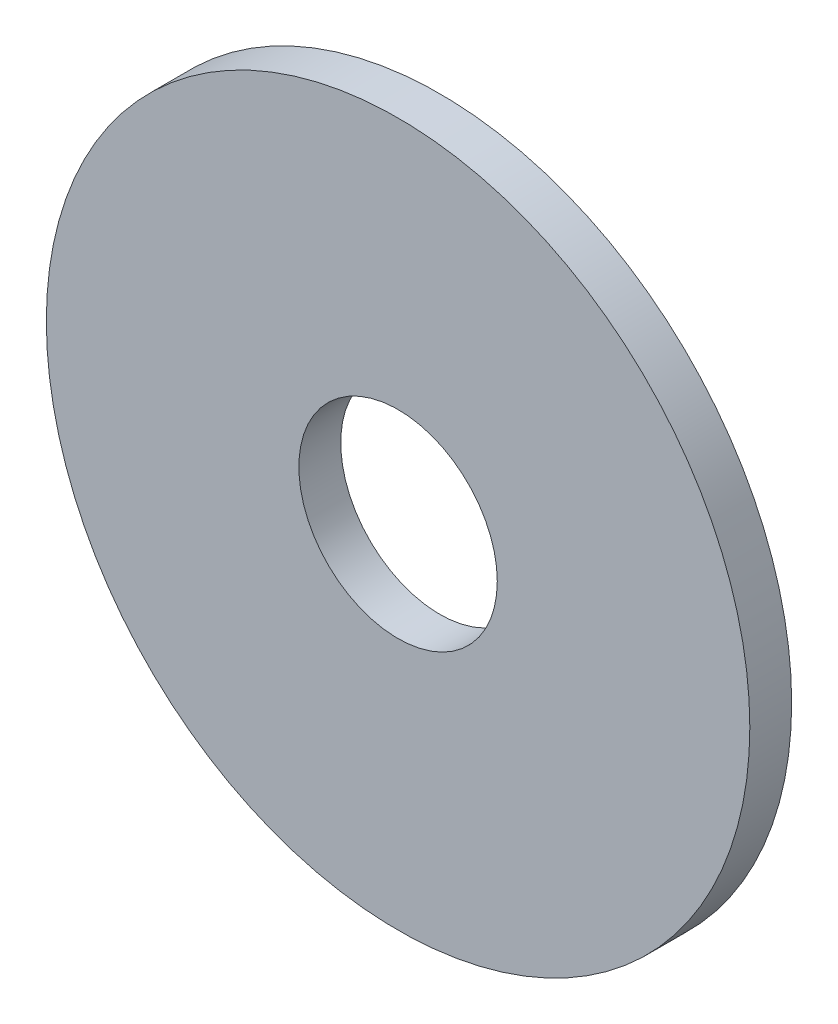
ISO-10303-21;
HEADER;
FILE_DESCRIPTION(('STEP AP214'),'2;1');
FILE_NAME('part.step','',(''),(''),'','','');
FILE_SCHEMA(('AUTOMOTIVE_DESIGN { 1 0 10303 214 1 1 1 1 }'));
ENDSEC;
DATA;
#1=APPLICATION_CONTEXT('core data for automotive mechanical design processes');
#2=APPLICATION_PROTOCOL_DEFINITION('international standard','automotive_design',2000,#1);
#3=PRODUCT_CONTEXT('',#1,'mechanical');
#4=PRODUCT('Part','Part','',(#3));
#5=PRODUCT_RELATED_PRODUCT_CATEGORY('part','',(#4));
#6=PRODUCT_DEFINITION_FORMATION('','',#4);
#7=PRODUCT_DEFINITION_CONTEXT('part definition',#1,'design');
#8=PRODUCT_DEFINITION('design','',#6,#7);
#9=PRODUCT_DEFINITION_SHAPE('','',#8);
#10=(LENGTH_UNIT() NAMED_UNIT(*) SI_UNIT(.MILLI.,.METRE.));
#11=(NAMED_UNIT(*) PLANE_ANGLE_UNIT() SI_UNIT($,.RADIAN.));
#12=(NAMED_UNIT(*) SI_UNIT($,.STERADIAN.) SOLID_ANGLE_UNIT());
#13=UNCERTAINTY_MEASURE_WITH_UNIT(LENGTH_MEASURE(1.E-05),#10,'distance_accuracy_value','');
#14=(GEOMETRIC_REPRESENTATION_CONTEXT(3) GLOBAL_UNCERTAINTY_ASSIGNED_CONTEXT((#13)) GLOBAL_UNIT_ASSIGNED_CONTEXT((#10,
#11,#12)) REPRESENTATION_CONTEXT('',''));
#15=CARTESIAN_POINT('',(0.,0.,0.));
#16=DIRECTION('',(0.,0.,1.));
#17=DIRECTION('',(1.,0.,0.));
#18=AXIS2_PLACEMENT_3D('',#15,#16,#17);
#19=CARTESIAN_POINT('',(0.,0.,0.));
#20=DIRECTION('',(0.,0.,-1.));
#21=DIRECTION('',(-1.,0.,0.));
#22=AXIS2_PLACEMENT_3D('',#19,#20,#21);
#23=PLANE('',#22);
#24=CARTESIAN_POINT('',(0.,0.,0.));
#25=DIRECTION('',(0.,0.,1.));
#26=DIRECTION('',(1.,0.,0.));
#27=AXIS2_PLACEMENT_3D('',#24,#25,#26);
#28=CIRCLE('',#27,2.75);
#29=CARTESIAN_POINT('',(2.75,0.,0.));
#30=VERTEX_POINT('',#29);
#31=EDGE_CURVE('E26',#30,#30,#28,.T.);
#32=ORIENTED_EDGE('',*,*,#31,.T.);
#33=EDGE_LOOP('',(#32));
#34=FACE_BOUND('',#33,.T.);
#35=CARTESIAN_POINT('',(0.,0.,0.));
#36=DIRECTION('',(0.,0.,1.));
#37=DIRECTION('',(1.,0.,0.));
#38=AXIS2_PLACEMENT_3D('',#35,#36,#37);
#39=CIRCLE('',#38,9.75);
#40=CARTESIAN_POINT('',(9.75,0.,0.));
#41=VERTEX_POINT('',#40);
#42=EDGE_CURVE('E17',#41,#41,#39,.T.);
#43=ORIENTED_EDGE('',*,*,#42,.F.);
#44=EDGE_LOOP('',(#43));
#45=FACE_BOUND('',#44,.T.);
#46=ADVANCED_FACE('F14',(#34,#45),#23,.T.);
#47=CARTESIAN_POINT('',(0.,0.,0.));
#48=DIRECTION('',(0.,0.,1.));
#49=DIRECTION('',(1.,0.,0.));
#50=AXIS2_PLACEMENT_3D('',#47,#48,#49);
#51=CYLINDRICAL_SURFACE('',#50,9.75);
#52=ORIENTED_EDGE('',*,*,#42,.T.);
#53=EDGE_LOOP('',(#52));
#54=FACE_BOUND('',#53,.T.);
#55=CARTESIAN_POINT('',(0.,0.,1.16));
#56=DIRECTION('',(0.,0.,1.));
#57=DIRECTION('',(1.,0.,0.));
#58=AXIS2_PLACEMENT_3D('',#55,#56,#57);
#59=CIRCLE('',#58,9.75);
#60=CARTESIAN_POINT('',(9.75,0.,1.16));
#61=VERTEX_POINT('',#60);
#62=EDGE_CURVE('E21',#61,#61,#59,.F.);
#63=ORIENTED_EDGE('',*,*,#62,.T.);
#64=EDGE_LOOP('',(#63));
#65=FACE_BOUND('',#64,.T.);
#66=ADVANCED_FACE('F34',(#54,#65),#51,.T.);
#67=CARTESIAN_POINT('',(0.,0.,0.));
#68=DIRECTION('',(0.,0.,1.));
#69=DIRECTION('',(1.,0.,0.));
#70=AXIS2_PLACEMENT_3D('',#67,#68,#69);
#71=CYLINDRICAL_SURFACE('',#70,2.75);
#72=ORIENTED_EDGE('',*,*,#31,.F.);
#73=EDGE_LOOP('',(#72));
#74=FACE_BOUND('',#73,.T.);
#75=CARTESIAN_POINT('',(0.,0.,1.16));
#76=DIRECTION('',(0.,0.,1.));
#77=DIRECTION('',(1.,0.,0.));
#78=AXIS2_PLACEMENT_3D('',#75,#76,#77);
#79=CIRCLE('',#78,2.75);
#80=CARTESIAN_POINT('',(2.75,0.,1.16));
#81=VERTEX_POINT('',#80);
#82=EDGE_CURVE('E10',#81,#81,#79,.T.);
#83=ORIENTED_EDGE('',*,*,#82,.T.);
#84=EDGE_LOOP('',(#83));
#85=FACE_BOUND('',#84,.T.);
#86=ADVANCED_FACE('F42',(#74,#85),#71,.F.);
#87=CARTESIAN_POINT('',(0.,0.,1.16));
#88=DIRECTION('',(0.,0.,-1.));
#89=DIRECTION('',(-1.,0.,0.));
#90=AXIS2_PLACEMENT_3D('',#87,#88,#89);
#91=PLANE('',#90);
#92=ORIENTED_EDGE('',*,*,#82,.F.);
#93=EDGE_LOOP('',(#92));
#94=FACE_BOUND('',#93,.T.);
#95=ORIENTED_EDGE('',*,*,#62,.F.);
#96=EDGE_LOOP('',(#95));
#97=FACE_BOUND('',#96,.T.);
#98=ADVANCED_FACE('F43',(#94,#97),#91,.F.);
#99=CLOSED_SHELL('',(#46,#66,#86,#98));
#100=MANIFOLD_SOLID_BREP('B1',#99);
#101=ADVANCED_BREP_SHAPE_REPRESENTATION('',(#18,#100),#14);
#102=SHAPE_DEFINITION_REPRESENTATION(#9,#101);
ENDSEC;
END-ISO-10303-21;
